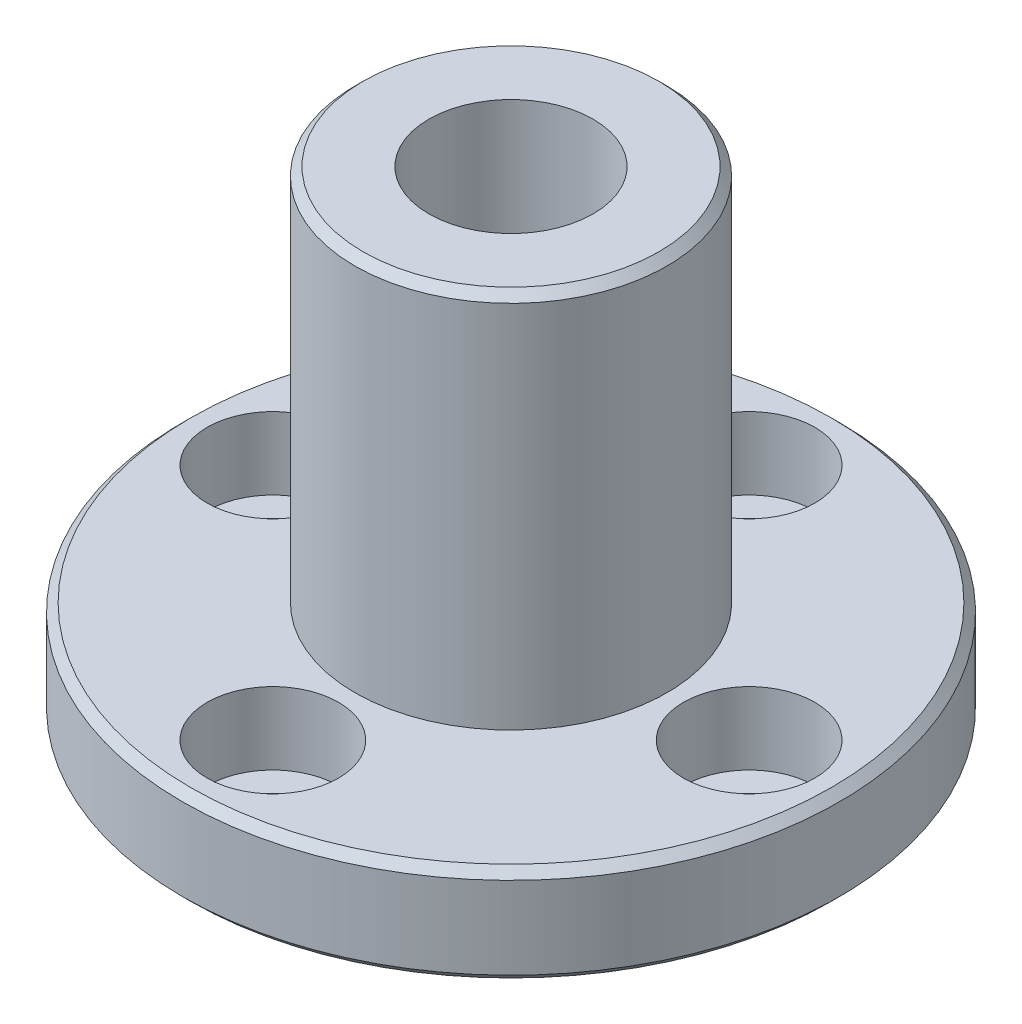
ISO-10303-21;
HEADER;
FILE_DESCRIPTION(('STEP AP214'),'2;1');
FILE_NAME('part.step','',(''),(''),'','','');
FILE_SCHEMA(('AUTOMOTIVE_DESIGN { 1 0 10303 214 1 1 1 1 }'));
ENDSEC;
DATA;
#1=APPLICATION_CONTEXT('core data for automotive mechanical design processes');
#2=APPLICATION_PROTOCOL_DEFINITION('international standard','automotive_design',2000,#1);
#3=PRODUCT_CONTEXT('',#1,'mechanical');
#4=PRODUCT('Part','Part','',(#3));
#5=PRODUCT_RELATED_PRODUCT_CATEGORY('part','',(#4));
#6=PRODUCT_DEFINITION_FORMATION('','',#4);
#7=PRODUCT_DEFINITION_CONTEXT('part definition',#1,'design');
#8=PRODUCT_DEFINITION('design','',#6,#7);
#9=PRODUCT_DEFINITION_SHAPE('','',#8);
#10=(LENGTH_UNIT() NAMED_UNIT(*) SI_UNIT(.MILLI.,.METRE.));
#11=(NAMED_UNIT(*) PLANE_ANGLE_UNIT() SI_UNIT($,.RADIAN.));
#12=(NAMED_UNIT(*) SI_UNIT($,.STERADIAN.) SOLID_ANGLE_UNIT());
#13=UNCERTAINTY_MEASURE_WITH_UNIT(LENGTH_MEASURE(1.E-05),#10,'distance_accuracy_value','');
#14=(GEOMETRIC_REPRESENTATION_CONTEXT(3) GLOBAL_UNCERTAINTY_ASSIGNED_CONTEXT((#13)) GLOBAL_UNIT_ASSIGNED_CONTEXT((#10,
#11,#12)) REPRESENTATION_CONTEXT('',''));
#15=CARTESIAN_POINT('',(0.,0.,0.));
#16=DIRECTION('',(0.,0.,1.));
#17=DIRECTION('',(1.,0.,0.));
#18=AXIS2_PLACEMENT_3D('',#15,#16,#17);
#19=CARTESIAN_POINT('',(0.,0.,0.));
#20=DIRECTION('',(0.,1.,0.));
#21=DIRECTION('',(0.,0.,1.));
#22=AXIS2_PLACEMENT_3D('',#19,#20,#21);
#23=CONICAL_SURFACE('',#22,19.5,0.785398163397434);
#24=CARTESIAN_POINT('',(0.,0.5,0.));
#25=DIRECTION('',(0.,1.,0.));
#26=DIRECTION('',(0.,0.,1.));
#27=AXIS2_PLACEMENT_3D('',#24,#25,#26);
#28=CIRCLE('',#27,20.);
#29=CARTESIAN_POINT('',(0.,0.5,20.));
#30=VERTEX_POINT('',#29);
#31=CARTESIAN_POINT('',(0.,0.5,-20.));
#32=VERTEX_POINT('',#31);
#33=EDGE_CURVE('E363',#30,#32,#28,.T.);
#34=ORIENTED_EDGE('',*,*,#33,.F.);
#35=CARTESIAN_POINT('',(0.,0.5,0.));
#36=DIRECTION('',(0.,1.,0.));
#37=DIRECTION('',(0.,0.,1.));
#38=AXIS2_PLACEMENT_3D('',#35,#36,#37);
#39=CIRCLE('',#38,20.);
#40=EDGE_CURVE('E367',#32,#30,#39,.T.);
#41=ORIENTED_EDGE('',*,*,#40,.F.);
#42=DIRECTION('',(0.,-0.707106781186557,0.707106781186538));
#43=VECTOR('',#42,1.);
#44=CARTESIAN_POINT('',(0.,0.,-19.5));
#45=LINE('',#44,#43);
#46=CARTESIAN_POINT('',(0.,0.,-19.5));
#47=VERTEX_POINT('',#46);
#48=EDGE_CURVE('E10',#32,#47,#45,.T.);
#49=ORIENTED_EDGE('',*,*,#48,.T.);
#50=CARTESIAN_POINT('',(0.,0.,0.));
#51=DIRECTION('',(0.,-1.,0.));
#52=DIRECTION('',(0.,0.,1.));
#53=AXIS2_PLACEMENT_3D('',#50,#51,#52);
#54=CIRCLE('',#53,19.5);
#55=CARTESIAN_POINT('',(0.,0.,19.5));
#56=VERTEX_POINT('',#55);
#57=EDGE_CURVE('E465',#56,#47,#54,.T.);
#58=ORIENTED_EDGE('',*,*,#57,.F.);
#59=CARTESIAN_POINT('',(0.,0.,0.));
#60=DIRECTION('',(0.,-1.,0.));
#61=DIRECTION('',(0.,0.,1.));
#62=AXIS2_PLACEMENT_3D('',#59,#60,#61);
#63=CIRCLE('',#62,19.5);
#64=EDGE_CURVE('E463',#47,#56,#63,.T.);
#65=ORIENTED_EDGE('',*,*,#64,.F.);
#66=ORIENTED_EDGE('',*,*,#48,.F.);
#67=EDGE_LOOP('',(#34,#41,#49,#58,#65,#66));
#68=FACE_BOUND('',#67,.T.);
#69=ADVANCED_FACE('F16',(#68),#23,.T.);
#70=CARTESIAN_POINT('',(0.,5.5,0.));
#71=DIRECTION('',(0.,-1.,0.));
#72=DIRECTION('',(0.,0.,-1.));
#73=AXIS2_PLACEMENT_3D('',#70,#71,#72);
#74=CONICAL_SURFACE('',#73,20.,0.785398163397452);
#75=CARTESIAN_POINT('',(0.,5.5,0.));
#76=DIRECTION('',(0.,-1.,0.));
#77=DIRECTION('',(0.,0.,-1.));
#78=AXIS2_PLACEMENT_3D('',#75,#76,#77);
#79=CIRCLE('',#78,20.);
#80=CARTESIAN_POINT('',(0.,5.5,-20.));
#81=VERTEX_POINT('',#80);
#82=CARTESIAN_POINT('',(0.,5.5,20.));
#83=VERTEX_POINT('',#82);
#84=EDGE_CURVE('E353',#81,#83,#79,.T.);
#85=ORIENTED_EDGE('',*,*,#84,.F.);
#86=CARTESIAN_POINT('',(0.,5.5,0.));
#87=DIRECTION('',(0.,-1.,0.));
#88=DIRECTION('',(0.,0.,-1.));
#89=AXIS2_PLACEMENT_3D('',#86,#87,#88);
#90=CIRCLE('',#89,20.);
#91=EDGE_CURVE('E349',#83,#81,#90,.T.);
#92=ORIENTED_EDGE('',*,*,#91,.F.);
#93=DIRECTION('',(0.,0.707106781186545,-0.70710678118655));
#94=VECTOR('',#93,1.);
#95=CARTESIAN_POINT('',(0.,5.5,20.));
#96=LINE('',#95,#94);
#97=CARTESIAN_POINT('',(0.,6.,19.5));
#98=VERTEX_POINT('',#97);
#99=EDGE_CURVE('E20',#83,#98,#96,.T.);
#100=ORIENTED_EDGE('',*,*,#99,.T.);
#101=CARTESIAN_POINT('',(0.,6.,0.));
#102=DIRECTION('',(0.,1.,0.));
#103=DIRECTION('',(0.,0.,-1.));
#104=AXIS2_PLACEMENT_3D('',#101,#102,#103);
#105=CIRCLE('',#104,19.5);
#106=CARTESIAN_POINT('',(0.,6.,-19.5));
#107=VERTEX_POINT('',#106);
#108=EDGE_CURVE('E359',#107,#98,#105,.T.);
#109=ORIENTED_EDGE('',*,*,#108,.F.);
#110=CARTESIAN_POINT('',(0.,6.,0.));
#111=DIRECTION('',(0.,1.,0.));
#112=DIRECTION('',(0.,0.,-1.));
#113=AXIS2_PLACEMENT_3D('',#110,#111,#112);
#114=CIRCLE('',#113,19.5);
#115=EDGE_CURVE('E355',#98,#107,#114,.T.);
#116=ORIENTED_EDGE('',*,*,#115,.F.);
#117=ORIENTED_EDGE('',*,*,#99,.F.);
#118=EDGE_LOOP('',(#85,#92,#100,#109,#116,#117));
#119=FACE_BOUND('',#118,.T.);
#120=ADVANCED_FACE('F455',(#119),#74,.T.);
#121=CARTESIAN_POINT('',(0.,28.5,0.));
#122=DIRECTION('',(0.,-1.,0.));
#123=DIRECTION('',(0.,0.,-1.));
#124=AXIS2_PLACEMENT_3D('',#121,#122,#123);
#125=CONICAL_SURFACE('',#124,9.5,0.785398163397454);
#126=CARTESIAN_POINT('',(0.,28.5,0.));
#127=DIRECTION('',(0.,-1.,0.));
#128=DIRECTION('',(0.,0.,-1.));
#129=AXIS2_PLACEMENT_3D('',#126,#127,#128);
#130=CIRCLE('',#129,9.5);
#131=CARTESIAN_POINT('',(0.,28.5,-9.5));
#132=VERTEX_POINT('',#131);
#133=CARTESIAN_POINT('',(0.,28.5,9.5));
#134=VERTEX_POINT('',#133);
#135=EDGE_CURVE('E423',#132,#134,#130,.T.);
#136=ORIENTED_EDGE('',*,*,#135,.F.);
#137=CARTESIAN_POINT('',(0.,28.5,0.));
#138=DIRECTION('',(0.,-1.,0.));
#139=DIRECTION('',(0.,0.,-1.));
#140=AXIS2_PLACEMENT_3D('',#137,#138,#139);
#141=CIRCLE('',#140,9.5);
#142=EDGE_CURVE('E419',#134,#132,#141,.T.);
#143=ORIENTED_EDGE('',*,*,#142,.F.);
#144=DIRECTION('',(0.,0.707106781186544,-0.707106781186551));
#145=VECTOR('',#144,1.);
#146=CARTESIAN_POINT('',(0.,28.5,9.5));
#147=LINE('',#146,#145);
#148=CARTESIAN_POINT('',(0.,29.,9.));
#149=VERTEX_POINT('',#148);
#150=EDGE_CURVE('E326',#134,#149,#147,.T.);
#151=ORIENTED_EDGE('',*,*,#150,.T.);
#152=CARTESIAN_POINT('',(0.,29.,0.));
#153=DIRECTION('',(0.,1.,0.));
#154=DIRECTION('',(0.,0.,-1.));
#155=AXIS2_PLACEMENT_3D('',#152,#153,#154);
#156=CIRCLE('',#155,9.);
#157=CARTESIAN_POINT('',(0.,29.,-9.));
#158=VERTEX_POINT('',#157);
#159=EDGE_CURVE('E258',#158,#149,#156,.T.);
#160=ORIENTED_EDGE('',*,*,#159,.F.);
#161=CARTESIAN_POINT('',(0.,29.,0.));
#162=DIRECTION('',(0.,1.,0.));
#163=DIRECTION('',(0.,0.,-1.));
#164=AXIS2_PLACEMENT_3D('',#161,#162,#163);
#165=CIRCLE('',#164,9.);
#166=EDGE_CURVE('E252',#149,#158,#165,.T.);
#167=ORIENTED_EDGE('',*,*,#166,.F.);
#168=ORIENTED_EDGE('',*,*,#150,.F.);
#169=EDGE_LOOP('',(#136,#143,#151,#160,#167,#168));
#170=FACE_BOUND('',#169,.T.);
#171=ADVANCED_FACE('F18',(#170),#125,.T.);
#172=CARTESIAN_POINT('',(0.,6.,-14.5));
#173=DIRECTION('',(0.,1.,0.));
#174=DIRECTION('',(0.,0.,1.));
#175=AXIS2_PLACEMENT_3D('',#172,#173,#174);
#176=CYLINDRICAL_SURFACE('',#175,4.);
#177=CARTESIAN_POINT('',(0.,1.6,-14.5));
#178=DIRECTION('',(0.,1.,0.));
#179=DIRECTION('',(0.,0.,1.));
#180=AXIS2_PLACEMENT_3D('',#177,#178,#179);
#181=CIRCLE('',#180,4.);
#182=CARTESIAN_POINT('',(0.,1.6,-10.5));
#183=VERTEX_POINT('',#182);
#184=CARTESIAN_POINT('',(0.,1.6,-18.5));
#185=VERTEX_POINT('',#184);
#186=EDGE_CURVE('E322',#183,#185,#181,.T.);
#187=ORIENTED_EDGE('',*,*,#186,.F.);
#188=CARTESIAN_POINT('',(0.,1.6,-14.5));
#189=DIRECTION('',(0.,1.,0.));
#190=DIRECTION('',(0.,0.,1.));
#191=AXIS2_PLACEMENT_3D('',#188,#189,#190);
#192=CIRCLE('',#191,4.);
#193=EDGE_CURVE('E46',#185,#183,#192,.T.);
#194=ORIENTED_EDGE('',*,*,#193,.F.);
#195=DIRECTION('',(0.,1.,0.));
#196=VECTOR('',#195,1.);
#197=CARTESIAN_POINT('',(0.,6.,-18.5));
#198=LINE('',#197,#196);
#199=CARTESIAN_POINT('',(0.,6.,-18.5));
#200=VERTEX_POINT('',#199);
#201=EDGE_CURVE('E38',#185,#200,#198,.T.);
#202=ORIENTED_EDGE('',*,*,#201,.T.);
#203=CARTESIAN_POINT('',(0.,6.,-14.5));
#204=DIRECTION('',(0.,1.,0.));
#205=DIRECTION('',(0.,0.,1.));
#206=AXIS2_PLACEMENT_3D('',#203,#204,#205);
#207=CIRCLE('',#206,4.);
#208=CARTESIAN_POINT('',(0.,6.,-10.5));
#209=VERTEX_POINT('',#208);
#210=EDGE_CURVE('E385',#200,#209,#207,.T.);
#211=ORIENTED_EDGE('',*,*,#210,.T.);
#212=CARTESIAN_POINT('',(0.,6.,-14.5));
#213=DIRECTION('',(0.,1.,0.));
#214=DIRECTION('',(0.,0.,1.));
#215=AXIS2_PLACEMENT_3D('',#212,#213,#214);
#216=CIRCLE('',#215,4.);
#217=EDGE_CURVE('E358',#209,#200,#216,.T.);
#218=ORIENTED_EDGE('',*,*,#217,.T.);
#219=ORIENTED_EDGE('',*,*,#201,.F.);
#220=EDGE_LOOP('',(#187,#194,#202,#211,#218,#219));
#221=FACE_BOUND('',#220,.T.);
#222=ADVANCED_FACE('F573',(#221),#176,.F.);
#223=CARTESIAN_POINT('',(2.25,1.6,-14.5));
#224=DIRECTION('',(0.,-1.,0.));
#225=DIRECTION('',(0.,0.,-1.));
#226=AXIS2_PLACEMENT_3D('',#223,#224,#225);
#227=PLANE('',#226);
#228=CARTESIAN_POINT('',(0.,1.6,-14.5));
#229=DIRECTION('',(0.,1.,0.));
#230=DIRECTION('',(0.,0.,1.));
#231=AXIS2_PLACEMENT_3D('',#228,#229,#230);
#232=CIRCLE('',#231,2.25);
#233=CARTESIAN_POINT('',(0.,1.6,-12.25));
#234=VERTEX_POINT('',#233);
#235=CARTESIAN_POINT('',(0.,1.6,-16.75));
#236=VERTEX_POINT('',#235);
#237=EDGE_CURVE('E317',#234,#236,#232,.T.);
#238=ORIENTED_EDGE('',*,*,#237,.F.);
#239=CARTESIAN_POINT('',(0.,1.6,-14.5));
#240=DIRECTION('',(0.,1.,0.));
#241=DIRECTION('',(0.,0.,1.));
#242=AXIS2_PLACEMENT_3D('',#239,#240,#241);
#243=CIRCLE('',#242,2.25);
#244=EDGE_CURVE('E306',#236,#234,#243,.T.);
#245=ORIENTED_EDGE('',*,*,#244,.F.);
#246=EDGE_LOOP('',(#238,#245));
#247=FACE_BOUND('',#246,.T.);
#248=ORIENTED_EDGE('',*,*,#186,.T.);
#249=ORIENTED_EDGE('',*,*,#193,.T.);
#250=EDGE_LOOP('',(#248,#249));
#251=FACE_BOUND('',#250,.T.);
#252=ADVANCED_FACE('F569',(#247,#251),#227,.F.);
#253=CARTESIAN_POINT('',(0.,6.,-14.5));
#254=DIRECTION('',(0.,1.,0.));
#255=DIRECTION('',(0.,0.,1.));
#256=AXIS2_PLACEMENT_3D('',#253,#254,#255);
#257=CYLINDRICAL_SURFACE('',#256,2.25);
#258=CARTESIAN_POINT('',(0.,0.,-14.5));
#259=DIRECTION('',(0.,1.,0.));
#260=DIRECTION('',(0.,0.,1.));
#261=AXIS2_PLACEMENT_3D('',#258,#259,#260);
#262=CIRCLE('',#261,2.25);
#263=CARTESIAN_POINT('',(0.,0.,-12.25));
#264=VERTEX_POINT('',#263);
#265=CARTESIAN_POINT('',(0.,0.,-16.75));
#266=VERTEX_POINT('',#265);
#267=EDGE_CURVE('E472',#264,#266,#262,.T.);
#268=ORIENTED_EDGE('',*,*,#267,.F.);
#269=CARTESIAN_POINT('',(0.,0.,-14.5));
#270=DIRECTION('',(0.,1.,0.));
#271=DIRECTION('',(0.,0.,1.));
#272=AXIS2_PLACEMENT_3D('',#269,#270,#271);
#273=CIRCLE('',#272,2.25);
#274=EDGE_CURVE('E486',#266,#264,#273,.T.);
#275=ORIENTED_EDGE('',*,*,#274,.F.);
#276=DIRECTION('',(0.,1.,0.));
#277=VECTOR('',#276,1.);
#278=CARTESIAN_POINT('',(0.,6.,-16.75));
#279=LINE('',#278,#277);
#280=EDGE_CURVE('E302',#266,#236,#279,.T.);
#281=ORIENTED_EDGE('',*,*,#280,.T.);
#282=ORIENTED_EDGE('',*,*,#244,.T.);
#283=ORIENTED_EDGE('',*,*,#237,.T.);
#284=ORIENTED_EDGE('',*,*,#280,.F.);
#285=EDGE_LOOP('',(#268,#275,#281,#282,#283,#284));
#286=FACE_BOUND('',#285,.T.);
#287=ADVANCED_FACE('F566',(#286),#257,.F.);
#288=CARTESIAN_POINT('',(14.5,6.,0.));
#289=DIRECTION('',(0.,1.,0.));
#290=DIRECTION('',(0.,0.,1.));
#291=AXIS2_PLACEMENT_3D('',#288,#289,#290);
#292=CYLINDRICAL_SURFACE('',#291,4.);
#293=CARTESIAN_POINT('',(14.5,1.6,0.));
#294=DIRECTION('',(0.,1.,0.));
#295=DIRECTION('',(0.,0.,1.));
#296=AXIS2_PLACEMENT_3D('',#293,#294,#295);
#297=CIRCLE('',#296,4.);
#298=CARTESIAN_POINT('',(14.5,1.6,4.));
#299=VERTEX_POINT('',#298);
#300=CARTESIAN_POINT('',(14.5,1.6,-4.));
#301=VERTEX_POINT('',#300);
#302=EDGE_CURVE('E310',#299,#301,#297,.T.);
#303=ORIENTED_EDGE('',*,*,#302,.F.);
#304=CARTESIAN_POINT('',(14.5,1.6,0.));
#305=DIRECTION('',(0.,1.,0.));
#306=DIRECTION('',(0.,0.,1.));
#307=AXIS2_PLACEMENT_3D('',#304,#305,#306);
#308=CIRCLE('',#307,4.);
#309=EDGE_CURVE('E311',#301,#299,#308,.T.);
#310=ORIENTED_EDGE('',*,*,#309,.F.);
#311=DIRECTION('',(0.,1.,0.));
#312=VECTOR('',#311,1.);
#313=CARTESIAN_POINT('',(14.5,6.,-4.));
#314=LINE('',#313,#312);
#315=CARTESIAN_POINT('',(14.5,6.,-4.));
#316=VERTEX_POINT('',#315);
#317=EDGE_CURVE('E307',#301,#316,#314,.T.);
#318=ORIENTED_EDGE('',*,*,#317,.T.);
#319=CARTESIAN_POINT('',(14.5,6.,0.));
#320=DIRECTION('',(0.,1.,0.));
#321=DIRECTION('',(0.,0.,1.));
#322=AXIS2_PLACEMENT_3D('',#319,#320,#321);
#323=CIRCLE('',#322,4.);
#324=CARTESIAN_POINT('',(14.5,6.,4.));
#325=VERTEX_POINT('',#324);
#326=EDGE_CURVE('E392',#316,#325,#323,.T.);
#327=ORIENTED_EDGE('',*,*,#326,.T.);
#328=CARTESIAN_POINT('',(14.5,6.,0.));
#329=DIRECTION('',(0.,1.,0.));
#330=DIRECTION('',(0.,0.,1.));
#331=AXIS2_PLACEMENT_3D('',#328,#329,#330);
#332=CIRCLE('',#331,4.);
#333=EDGE_CURVE('E388',#325,#316,#332,.T.);
#334=ORIENTED_EDGE('',*,*,#333,.T.);
#335=ORIENTED_EDGE('',*,*,#317,.F.);
#336=EDGE_LOOP('',(#303,#310,#318,#327,#334,#335));
#337=FACE_BOUND('',#336,.T.);
#338=ADVANCED_FACE('F558',(#337),#292,.F.);
#339=CARTESIAN_POINT('',(16.75,1.6,0.));
#340=DIRECTION('',(0.,-1.,0.));
#341=DIRECTION('',(0.,0.,-1.));
#342=AXIS2_PLACEMENT_3D('',#339,#340,#341);
#343=PLANE('',#342);
#344=CARTESIAN_POINT('',(14.5,1.6,0.));
#345=DIRECTION('',(0.,1.,0.));
#346=DIRECTION('',(0.,0.,1.));
#347=AXIS2_PLACEMENT_3D('',#344,#345,#346);
#348=CIRCLE('',#347,2.25);
#349=CARTESIAN_POINT('',(14.5,1.6,2.25));
#350=VERTEX_POINT('',#349);
#351=CARTESIAN_POINT('',(14.5,1.6,-2.25));
#352=VERTEX_POINT('',#351);
#353=EDGE_CURVE('E301',#350,#352,#348,.T.);
#354=ORIENTED_EDGE('',*,*,#353,.F.);
#355=CARTESIAN_POINT('',(14.5,1.6,0.));
#356=DIRECTION('',(0.,1.,0.));
#357=DIRECTION('',(0.,0.,1.));
#358=AXIS2_PLACEMENT_3D('',#355,#356,#357);
#359=CIRCLE('',#358,2.25);
#360=EDGE_CURVE('E297',#352,#350,#359,.T.);
#361=ORIENTED_EDGE('',*,*,#360,.F.);
#362=EDGE_LOOP('',(#354,#361));
#363=FACE_BOUND('',#362,.T.);
#364=ORIENTED_EDGE('',*,*,#302,.T.);
#365=ORIENTED_EDGE('',*,*,#309,.T.);
#366=EDGE_LOOP('',(#364,#365));
#367=FACE_BOUND('',#366,.T.);
#368=ADVANCED_FACE('F549',(#363,#367),#343,.F.);
#369=CARTESIAN_POINT('',(14.5,6.,0.));
#370=DIRECTION('',(0.,1.,0.));
#371=DIRECTION('',(0.,0.,1.));
#372=AXIS2_PLACEMENT_3D('',#369,#370,#371);
#373=CYLINDRICAL_SURFACE('',#372,2.25);
#374=CARTESIAN_POINT('',(14.5,0.,0.));
#375=DIRECTION('',(0.,1.,0.));
#376=DIRECTION('',(0.,0.,1.));
#377=AXIS2_PLACEMENT_3D('',#374,#375,#376);
#378=CIRCLE('',#377,2.25);
#379=CARTESIAN_POINT('',(14.5,0.,2.25));
#380=VERTEX_POINT('',#379);
#381=CARTESIAN_POINT('',(14.5,0.,-2.25));
#382=VERTEX_POINT('',#381);
#383=EDGE_CURVE('E497',#380,#382,#378,.T.);
#384=ORIENTED_EDGE('',*,*,#383,.F.);
#385=CARTESIAN_POINT('',(14.5,0.,0.));
#386=DIRECTION('',(0.,1.,0.));
#387=DIRECTION('',(0.,0.,1.));
#388=AXIS2_PLACEMENT_3D('',#385,#386,#387);
#389=CIRCLE('',#388,2.25);
#390=EDGE_CURVE('E491',#382,#380,#389,.T.);
#391=ORIENTED_EDGE('',*,*,#390,.F.);
#392=DIRECTION('',(0.,1.,0.));
#393=VECTOR('',#392,1.);
#394=CARTESIAN_POINT('',(14.5,6.,-2.25));
#395=LINE('',#394,#393);
#396=EDGE_CURVE('E292',#382,#352,#395,.T.);
#397=ORIENTED_EDGE('',*,*,#396,.T.);
#398=ORIENTED_EDGE('',*,*,#360,.T.);
#399=ORIENTED_EDGE('',*,*,#353,.T.);
#400=ORIENTED_EDGE('',*,*,#396,.F.);
#401=EDGE_LOOP('',(#384,#391,#397,#398,#399,#400));
#402=FACE_BOUND('',#401,.T.);
#403=ADVANCED_FACE('F541',(#402),#373,.F.);
#404=CARTESIAN_POINT('',(0.,6.,14.5));
#405=DIRECTION('',(0.,1.,0.));
#406=DIRECTION('',(0.,0.,1.));
#407=AXIS2_PLACEMENT_3D('',#404,#405,#406);
#408=CYLINDRICAL_SURFACE('',#407,4.);
#409=CARTESIAN_POINT('',(0.,1.6,14.5));
#410=DIRECTION('',(0.,1.,0.));
#411=DIRECTION('',(0.,0.,1.));
#412=AXIS2_PLACEMENT_3D('',#409,#410,#411);
#413=CIRCLE('',#412,4.);
#414=CARTESIAN_POINT('',(0.,1.6,18.5));
#415=VERTEX_POINT('',#414);
#416=CARTESIAN_POINT('',(0.,1.6,10.5));
#417=VERTEX_POINT('',#416);
#418=EDGE_CURVE('E287',#415,#417,#413,.T.);
#419=ORIENTED_EDGE('',*,*,#418,.F.);
#420=CARTESIAN_POINT('',(0.,1.6,14.5));
#421=DIRECTION('',(0.,1.,0.));
#422=DIRECTION('',(0.,0.,1.));
#423=AXIS2_PLACEMENT_3D('',#420,#421,#422);
#424=CIRCLE('',#423,4.);
#425=EDGE_CURVE('E293',#417,#415,#424,.T.);
#426=ORIENTED_EDGE('',*,*,#425,.F.);
#427=DIRECTION('',(0.,1.,0.));
#428=VECTOR('',#427,1.);
#429=CARTESIAN_POINT('',(0.,6.,10.5));
#430=LINE('',#429,#428);
#431=CARTESIAN_POINT('',(0.,6.,10.5));
#432=VERTEX_POINT('',#431);
#433=EDGE_CURVE('E289',#417,#432,#430,.T.);
#434=ORIENTED_EDGE('',*,*,#433,.T.);
#435=CARTESIAN_POINT('',(0.,6.,14.5));
#436=DIRECTION('',(0.,1.,0.));
#437=DIRECTION('',(0.,0.,1.));
#438=AXIS2_PLACEMENT_3D('',#435,#436,#437);
#439=CIRCLE('',#438,4.);
#440=CARTESIAN_POINT('',(0.,6.,18.5));
#441=VERTEX_POINT('',#440);
#442=EDGE_CURVE('E398',#432,#441,#439,.T.);
#443=ORIENTED_EDGE('',*,*,#442,.T.);
#444=CARTESIAN_POINT('',(0.,6.,14.5));
#445=DIRECTION('',(0.,1.,0.));
#446=DIRECTION('',(0.,0.,1.));
#447=AXIS2_PLACEMENT_3D('',#444,#445,#446);
#448=CIRCLE('',#447,4.);
#449=EDGE_CURVE('E395',#441,#432,#448,.T.);
#450=ORIENTED_EDGE('',*,*,#449,.T.);
#451=ORIENTED_EDGE('',*,*,#433,.F.);
#452=EDGE_LOOP('',(#419,#426,#434,#443,#450,#451));
#453=FACE_BOUND('',#452,.T.);
#454=ADVANCED_FACE('F538',(#453),#408,.F.);
#455=CARTESIAN_POINT('',(2.25,1.6,14.5));
#456=DIRECTION('',(0.,-1.,0.));
#457=DIRECTION('',(0.,0.,-1.));
#458=AXIS2_PLACEMENT_3D('',#455,#456,#457);
#459=PLANE('',#458);
#460=CARTESIAN_POINT('',(0.,1.6,14.5));
#461=DIRECTION('',(0.,1.,0.));
#462=DIRECTION('',(0.,0.,1.));
#463=AXIS2_PLACEMENT_3D('',#460,#461,#462);
#464=CIRCLE('',#463,2.25);
#465=CARTESIAN_POINT('',(0.,1.6,16.75));
#466=VERTEX_POINT('',#465);
#467=CARTESIAN_POINT('',(0.,1.6,12.25));
#468=VERTEX_POINT('',#467);
#469=EDGE_CURVE('E284',#466,#468,#464,.T.);
#470=ORIENTED_EDGE('',*,*,#469,.F.);
#471=CARTESIAN_POINT('',(0.,1.6,14.5));
#472=DIRECTION('',(0.,1.,0.));
#473=DIRECTION('',(0.,0.,1.));
#474=AXIS2_PLACEMENT_3D('',#471,#472,#473);
#475=CIRCLE('',#474,2.25);
#476=EDGE_CURVE('E288',#468,#466,#475,.T.);
#477=ORIENTED_EDGE('',*,*,#476,.F.);
#478=EDGE_LOOP('',(#470,#477));
#479=FACE_BOUND('',#478,.T.);
#480=ORIENTED_EDGE('',*,*,#418,.T.);
#481=ORIENTED_EDGE('',*,*,#425,.T.);
#482=EDGE_LOOP('',(#480,#481));
#483=FACE_BOUND('',#482,.T.);
#484=ADVANCED_FACE('F540',(#479,#483),#459,.F.);
#485=CARTESIAN_POINT('',(0.,6.,14.5));
#486=DIRECTION('',(0.,1.,0.));
#487=DIRECTION('',(0.,0.,1.));
#488=AXIS2_PLACEMENT_3D('',#485,#486,#487);
#489=CYLINDRICAL_SURFACE('',#488,2.25);
#490=CARTESIAN_POINT('',(0.,0.,14.5));
#491=DIRECTION('',(0.,1.,0.));
#492=DIRECTION('',(0.,0.,1.));
#493=AXIS2_PLACEMENT_3D('',#490,#491,#492);
#494=CIRCLE('',#493,2.25);
#495=CARTESIAN_POINT('',(0.,0.,16.75));
#496=VERTEX_POINT('',#495);
#497=CARTESIAN_POINT('',(0.,0.,12.25));
#498=VERTEX_POINT('',#497);
#499=EDGE_CURVE('E487',#496,#498,#494,.T.);
#500=ORIENTED_EDGE('',*,*,#499,.F.);
#501=CARTESIAN_POINT('',(0.,0.,14.5));
#502=DIRECTION('',(0.,1.,0.));
#503=DIRECTION('',(0.,0.,1.));
#504=AXIS2_PLACEMENT_3D('',#501,#502,#503);
#505=CIRCLE('',#504,2.25);
#506=EDGE_CURVE('E342',#498,#496,#505,.T.);
#507=ORIENTED_EDGE('',*,*,#506,.F.);
#508=DIRECTION('',(0.,1.,0.));
#509=VECTOR('',#508,1.);
#510=CARTESIAN_POINT('',(0.,6.,12.25));
#511=LINE('',#510,#509);
#512=EDGE_CURVE('E283',#498,#468,#511,.T.);
#513=ORIENTED_EDGE('',*,*,#512,.T.);
#514=ORIENTED_EDGE('',*,*,#476,.T.);
#515=ORIENTED_EDGE('',*,*,#469,.T.);
#516=ORIENTED_EDGE('',*,*,#512,.F.);
#517=EDGE_LOOP('',(#500,#507,#513,#514,#515,#516));
#518=FACE_BOUND('',#517,.T.);
#519=ADVANCED_FACE('F527',(#518),#489,.F.);
#520=CARTESIAN_POINT('',(-14.5,6.,0.));
#521=DIRECTION('',(0.,1.,0.));
#522=DIRECTION('',(0.,0.,1.));
#523=AXIS2_PLACEMENT_3D('',#520,#521,#522);
#524=CYLINDRICAL_SURFACE('',#523,4.);
#525=CARTESIAN_POINT('',(-14.5,1.6,0.));
#526=DIRECTION('',(0.,1.,0.));
#527=DIRECTION('',(0.,0.,1.));
#528=AXIS2_PLACEMENT_3D('',#525,#526,#527);
#529=CIRCLE('',#528,4.);
#530=CARTESIAN_POINT('',(-14.5,1.6,4.));
#531=VERTEX_POINT('',#530);
#532=CARTESIAN_POINT('',(-14.5,1.6,-4.));
#533=VERTEX_POINT('',#532);
#534=EDGE_CURVE('E273',#531,#533,#529,.T.);
#535=ORIENTED_EDGE('',*,*,#534,.F.);
#536=CARTESIAN_POINT('',(-14.5,1.6,0.));
#537=DIRECTION('',(0.,1.,0.));
#538=DIRECTION('',(0.,0.,1.));
#539=AXIS2_PLACEMENT_3D('',#536,#537,#538);
#540=CIRCLE('',#539,4.);
#541=EDGE_CURVE('E277',#533,#531,#540,.T.);
#542=ORIENTED_EDGE('',*,*,#541,.F.);
#543=DIRECTION('',(0.,1.,0.));
#544=VECTOR('',#543,1.);
#545=CARTESIAN_POINT('',(-14.5,6.,-4.));
#546=LINE('',#545,#544);
#547=CARTESIAN_POINT('',(-14.5,6.,-4.));
#548=VERTEX_POINT('',#547);
#549=EDGE_CURVE('E280',#533,#548,#546,.T.);
#550=ORIENTED_EDGE('',*,*,#549,.T.);
#551=CARTESIAN_POINT('',(-14.5,6.,0.));
#552=DIRECTION('',(0.,1.,0.));
#553=DIRECTION('',(0.,0.,1.));
#554=AXIS2_PLACEMENT_3D('',#551,#552,#553);
#555=CIRCLE('',#554,4.);
#556=CARTESIAN_POINT('',(-14.5,6.,4.));
#557=VERTEX_POINT('',#556);
#558=EDGE_CURVE('E410',#548,#557,#555,.T.);
#559=ORIENTED_EDGE('',*,*,#558,.T.);
#560=CARTESIAN_POINT('',(-14.5,6.,0.));
#561=DIRECTION('',(0.,1.,0.));
#562=DIRECTION('',(0.,0.,1.));
#563=AXIS2_PLACEMENT_3D('',#560,#561,#562);
#564=CIRCLE('',#563,4.);
#565=EDGE_CURVE('E402',#557,#548,#564,.T.);
#566=ORIENTED_EDGE('',*,*,#565,.T.);
#567=ORIENTED_EDGE('',*,*,#549,.F.);
#568=EDGE_LOOP('',(#535,#542,#550,#559,#566,#567));
#569=FACE_BOUND('',#568,.T.);
#570=ADVANCED_FACE('F512',(#569),#524,.F.);
#571=CARTESIAN_POINT('',(-12.25,1.6,0.));
#572=DIRECTION('',(0.,-1.,0.));
#573=DIRECTION('',(0.,0.,-1.));
#574=AXIS2_PLACEMENT_3D('',#571,#572,#573);
#575=PLANE('',#574);
#576=CARTESIAN_POINT('',(-14.5,1.6,0.));
#577=DIRECTION('',(0.,1.,0.));
#578=DIRECTION('',(0.,0.,1.));
#579=AXIS2_PLACEMENT_3D('',#576,#577,#578);
#580=CIRCLE('',#579,2.25);
#581=CARTESIAN_POINT('',(-14.5,1.6,2.25));
#582=VERTEX_POINT('',#581);
#583=CARTESIAN_POINT('',(-14.5,1.6,-2.25));
#584=VERTEX_POINT('',#583);
#585=EDGE_CURVE('E270',#582,#584,#580,.T.);
#586=ORIENTED_EDGE('',*,*,#585,.F.);
#587=CARTESIAN_POINT('',(-14.5,1.6,0.));
#588=DIRECTION('',(0.,1.,0.));
#589=DIRECTION('',(0.,0.,1.));
#590=AXIS2_PLACEMENT_3D('',#587,#588,#589);
#591=CIRCLE('',#590,2.25);
#592=EDGE_CURVE('E266',#584,#582,#591,.T.);
#593=ORIENTED_EDGE('',*,*,#592,.F.);
#594=EDGE_LOOP('',(#586,#593));
#595=FACE_BOUND('',#594,.T.);
#596=ORIENTED_EDGE('',*,*,#534,.T.);
#597=ORIENTED_EDGE('',*,*,#541,.T.);
#598=EDGE_LOOP('',(#596,#597));
#599=FACE_BOUND('',#598,.T.);
#600=ADVANCED_FACE('F515',(#595,#599),#575,.F.);
#601=CARTESIAN_POINT('',(-14.5,6.,0.));
#602=DIRECTION('',(0.,1.,0.));
#603=DIRECTION('',(0.,0.,1.));
#604=AXIS2_PLACEMENT_3D('',#601,#602,#603);
#605=CYLINDRICAL_SURFACE('',#604,2.25);
#606=CARTESIAN_POINT('',(-14.5,0.,0.));
#607=DIRECTION('',(0.,1.,0.));
#608=DIRECTION('',(0.,0.,1.));
#609=AXIS2_PLACEMENT_3D('',#606,#607,#608);
#610=CIRCLE('',#609,2.25);
#611=CARTESIAN_POINT('',(-14.5,0.,2.25));
#612=VERTEX_POINT('',#611);
#613=CARTESIAN_POINT('',(-14.5,0.,-2.25));
#614=VERTEX_POINT('',#613);
#615=EDGE_CURVE('E348',#612,#614,#610,.T.);
#616=ORIENTED_EDGE('',*,*,#615,.F.);
#617=CARTESIAN_POINT('',(-14.5,0.,0.));
#618=DIRECTION('',(0.,1.,0.));
#619=DIRECTION('',(0.,0.,1.));
#620=AXIS2_PLACEMENT_3D('',#617,#618,#619);
#621=CIRCLE('',#620,2.25);
#622=EDGE_CURVE('E344',#614,#612,#621,.T.);
#623=ORIENTED_EDGE('',*,*,#622,.F.);
#624=DIRECTION('',(0.,1.,0.));
#625=VECTOR('',#624,1.);
#626=CARTESIAN_POINT('',(-14.5,6.,-2.25));
#627=LINE('',#626,#625);
#628=EDGE_CURVE('E262',#614,#584,#627,.T.);
#629=ORIENTED_EDGE('',*,*,#628,.T.);
#630=ORIENTED_EDGE('',*,*,#592,.T.);
#631=ORIENTED_EDGE('',*,*,#585,.T.);
#632=ORIENTED_EDGE('',*,*,#628,.F.);
#633=EDGE_LOOP('',(#616,#623,#629,#630,#631,#632));
#634=FACE_BOUND('',#633,.T.);
#635=ADVANCED_FACE('F517',(#634),#605,.F.);
#636=CARTESIAN_POINT('',(0.,29.,0.));
#637=DIRECTION('',(0.,-1.,0.));
#638=DIRECTION('',(0.,0.,-1.));
#639=AXIS2_PLACEMENT_3D('',#636,#637,#638);
#640=CYLINDRICAL_SURFACE('',#639,5.);
#641=CARTESIAN_POINT('',(0.,29.,0.));
#642=DIRECTION('',(0.,-1.,0.));
#643=DIRECTION('',(0.,0.,-1.));
#644=AXIS2_PLACEMENT_3D('',#641,#642,#643);
#645=CIRCLE('',#644,5.);
#646=CARTESIAN_POINT('',(0.,29.,-5.));
#647=VERTEX_POINT('',#646);
#648=CARTESIAN_POINT('',(0.,29.,5.));
#649=VERTEX_POINT('',#648);
#650=EDGE_CURVE('E244',#647,#649,#645,.T.);
#651=ORIENTED_EDGE('',*,*,#650,.F.);
#652=CARTESIAN_POINT('',(0.,29.,0.));
#653=DIRECTION('',(0.,-1.,0.));
#654=DIRECTION('',(0.,0.,-1.));
#655=AXIS2_PLACEMENT_3D('',#652,#653,#654);
#656=CIRCLE('',#655,5.);
#657=EDGE_CURVE('E240',#649,#647,#656,.T.);
#658=ORIENTED_EDGE('',*,*,#657,.F.);
#659=DIRECTION('',(0.,-1.,0.));
#660=VECTOR('',#659,1.);
#661=CARTESIAN_POINT('',(0.,29.,5.));
#662=LINE('',#661,#660);
#663=CARTESIAN_POINT('',(0.,0.,5.));
#664=VERTEX_POINT('',#663);
#665=EDGE_CURVE('E247',#649,#664,#662,.T.);
#666=ORIENTED_EDGE('',*,*,#665,.T.);
#667=CARTESIAN_POINT('',(0.,0.,0.));
#668=DIRECTION('',(0.,-1.,0.));
#669=DIRECTION('',(0.,0.,-1.));
#670=AXIS2_PLACEMENT_3D('',#667,#668,#669);
#671=CIRCLE('',#670,5.);
#672=CARTESIAN_POINT('',(0.,0.,-5.));
#673=VERTEX_POINT('',#672);
#674=EDGE_CURVE('E360',#664,#673,#671,.T.);
#675=ORIENTED_EDGE('',*,*,#674,.T.);
#676=CARTESIAN_POINT('',(0.,0.,0.));
#677=DIRECTION('',(0.,-1.,0.));
#678=DIRECTION('',(0.,0.,-1.));
#679=AXIS2_PLACEMENT_3D('',#676,#677,#678);
#680=CIRCLE('',#679,5.);
#681=EDGE_CURVE('E347',#673,#664,#680,.T.);
#682=ORIENTED_EDGE('',*,*,#681,.T.);
#683=ORIENTED_EDGE('',*,*,#665,.F.);
#684=EDGE_LOOP('',(#651,#658,#666,#675,#682,#683));
#685=FACE_BOUND('',#684,.T.);
#686=ADVANCED_FACE('F249',(#685),#640,.F.);
#687=CARTESIAN_POINT('',(-9.5,29.,0.));
#688=DIRECTION('',(0.,-1.,0.));
#689=DIRECTION('',(0.,0.,-1.));
#690=AXIS2_PLACEMENT_3D('',#687,#688,#689);
#691=PLANE('',#690);
#692=ORIENTED_EDGE('',*,*,#650,.T.);
#693=ORIENTED_EDGE('',*,*,#657,.T.);
#694=EDGE_LOOP('',(#692,#693));
#695=FACE_BOUND('',#694,.T.);
#696=ORIENTED_EDGE('',*,*,#159,.T.);
#697=ORIENTED_EDGE('',*,*,#166,.T.);
#698=EDGE_LOOP('',(#696,#697));
#699=FACE_BOUND('',#698,.T.);
#700=ADVANCED_FACE('F242',(#695,#699),#691,.F.);
#701=CARTESIAN_POINT('',(0.,0.,0.));
#702=DIRECTION('',(0.,-1.,0.));
#703=DIRECTION('',(0.,0.,-1.));
#704=AXIS2_PLACEMENT_3D('',#701,#702,#703);
#705=CYLINDRICAL_SURFACE('',#704,9.5);
#706=CARTESIAN_POINT('',(0.,6.,0.));
#707=DIRECTION('',(0.,-1.,0.));
#708=DIRECTION('',(0.,0.,-1.));
#709=AXIS2_PLACEMENT_3D('',#706,#707,#708);
#710=CIRCLE('',#709,9.5);
#711=CARTESIAN_POINT('',(0.,6.,-9.5));
#712=VERTEX_POINT('',#711);
#713=CARTESIAN_POINT('',(0.,6.,9.5));
#714=VERTEX_POINT('',#713);
#715=EDGE_CURVE('E405',#712,#714,#710,.T.);
#716=ORIENTED_EDGE('',*,*,#715,.F.);
#717=CARTESIAN_POINT('',(0.,6.,0.));
#718=DIRECTION('',(0.,-1.,0.));
#719=DIRECTION('',(0.,0.,-1.));
#720=AXIS2_PLACEMENT_3D('',#717,#718,#719);
#721=CIRCLE('',#720,9.5);
#722=EDGE_CURVE('E409',#714,#712,#721,.T.);
#723=ORIENTED_EDGE('',*,*,#722,.F.);
#724=DIRECTION('',(0.,1.,0.));
#725=VECTOR('',#724,1.);
#726=CARTESIAN_POINT('',(0.,0.,9.5));
#727=LINE('',#726,#725);
#728=EDGE_CURVE('E413',#714,#134,#727,.T.);
#729=ORIENTED_EDGE('',*,*,#728,.T.);
#730=ORIENTED_EDGE('',*,*,#142,.T.);
#731=ORIENTED_EDGE('',*,*,#135,.T.);
#732=ORIENTED_EDGE('',*,*,#728,.F.);
#733=EDGE_LOOP('',(#716,#723,#729,#730,#731,#732));
#734=FACE_BOUND('',#733,.T.);
#735=ADVANCED_FACE('F432',(#734),#705,.T.);
#736=CARTESIAN_POINT('',(-20.,6.,0.));
#737=DIRECTION('',(0.,-1.,0.));
#738=DIRECTION('',(0.,0.,-1.));
#739=AXIS2_PLACEMENT_3D('',#736,#737,#738);
#740=PLANE('',#739);
#741=ORIENTED_EDGE('',*,*,#715,.T.);
#742=ORIENTED_EDGE('',*,*,#722,.T.);
#743=EDGE_LOOP('',(#741,#742));
#744=FACE_BOUND('',#743,.T.);
#745=ORIENTED_EDGE('',*,*,#565,.F.);
#746=ORIENTED_EDGE('',*,*,#558,.F.);
#747=EDGE_LOOP('',(#745,#746));
#748=FACE_BOUND('',#747,.T.);
#749=ORIENTED_EDGE('',*,*,#449,.F.);
#750=ORIENTED_EDGE('',*,*,#442,.F.);
#751=EDGE_LOOP('',(#749,#750));
#752=FACE_BOUND('',#751,.T.);
#753=ORIENTED_EDGE('',*,*,#333,.F.);
#754=ORIENTED_EDGE('',*,*,#326,.F.);
#755=EDGE_LOOP('',(#753,#754));
#756=FACE_BOUND('',#755,.T.);
#757=ORIENTED_EDGE('',*,*,#217,.F.);
#758=ORIENTED_EDGE('',*,*,#210,.F.);
#759=EDGE_LOOP('',(#757,#758));
#760=FACE_BOUND('',#759,.T.);
#761=ORIENTED_EDGE('',*,*,#108,.T.);
#762=ORIENTED_EDGE('',*,*,#115,.T.);
#763=EDGE_LOOP('',(#761,#762));
#764=FACE_BOUND('',#763,.T.);
#765=ADVANCED_FACE('F435',(#744,#748,#752,#756,#760,#764),#740,.F.);
#766=CARTESIAN_POINT('',(0.,0.,0.));
#767=DIRECTION('',(0.,-1.,0.));
#768=DIRECTION('',(0.,0.,-1.));
#769=AXIS2_PLACEMENT_3D('',#766,#767,#768);
#770=CYLINDRICAL_SURFACE('',#769,20.);
#771=ORIENTED_EDGE('',*,*,#33,.T.);
#772=ORIENTED_EDGE('',*,*,#40,.T.);
#773=DIRECTION('',(0.,1.,0.));
#774=VECTOR('',#773,1.);
#775=CARTESIAN_POINT('',(0.,0.,20.));
#776=LINE('',#775,#774);
#777=EDGE_CURVE('E354',#30,#83,#776,.T.);
#778=ORIENTED_EDGE('',*,*,#777,.T.);
#779=ORIENTED_EDGE('',*,*,#91,.T.);
#780=ORIENTED_EDGE('',*,*,#84,.T.);
#781=ORIENTED_EDGE('',*,*,#777,.F.);
#782=EDGE_LOOP('',(#771,#772,#778,#779,#780,#781));
#783=FACE_BOUND('',#782,.T.);
#784=ADVANCED_FACE('F438',(#783),#770,.T.);
#785=CARTESIAN_POINT('',(0.,0.,0.));
#786=DIRECTION('',(0.,1.,0.));
#787=DIRECTION('',(1.,0.,0.));
#788=AXIS2_PLACEMENT_3D('',#785,#786,#787);
#789=PLANE('',#788);
#790=ORIENTED_EDGE('',*,*,#681,.F.);
#791=ORIENTED_EDGE('',*,*,#674,.F.);
#792=EDGE_LOOP('',(#790,#791));
#793=FACE_BOUND('',#792,.T.);
#794=ORIENTED_EDGE('',*,*,#615,.T.);
#795=ORIENTED_EDGE('',*,*,#622,.T.);
#796=EDGE_LOOP('',(#794,#795));
#797=FACE_BOUND('',#796,.T.);
#798=ORIENTED_EDGE('',*,*,#499,.T.);
#799=ORIENTED_EDGE('',*,*,#506,.T.);
#800=EDGE_LOOP('',(#798,#799));
#801=FACE_BOUND('',#800,.T.);
#802=ORIENTED_EDGE('',*,*,#383,.T.);
#803=ORIENTED_EDGE('',*,*,#390,.T.);
#804=EDGE_LOOP('',(#802,#803));
#805=FACE_BOUND('',#804,.T.);
#806=ORIENTED_EDGE('',*,*,#267,.T.);
#807=ORIENTED_EDGE('',*,*,#274,.T.);
#808=EDGE_LOOP('',(#806,#807));
#809=FACE_BOUND('',#808,.T.);
#810=ORIENTED_EDGE('',*,*,#57,.T.);
#811=ORIENTED_EDGE('',*,*,#64,.T.);
#812=EDGE_LOOP('',(#810,#811));
#813=FACE_BOUND('',#812,.T.);
#814=ADVANCED_FACE('F729',(#793,#797,#801,#805,#809,#813),#789,.F.);
#815=CLOSED_SHELL('',(#69,#120,#171,#222,#252,#287,#338,#368,#403,#454,#484,#519,#570,#600,#635,
#686,#700,#735,#765,#784,#814));
#816=MANIFOLD_SOLID_BREP('B1',#815);
#817=ADVANCED_BREP_SHAPE_REPRESENTATION('',(#18,#816),#14);
#818=SHAPE_DEFINITION_REPRESENTATION(#9,#817);
ENDSEC;
END-ISO-10303-21;
